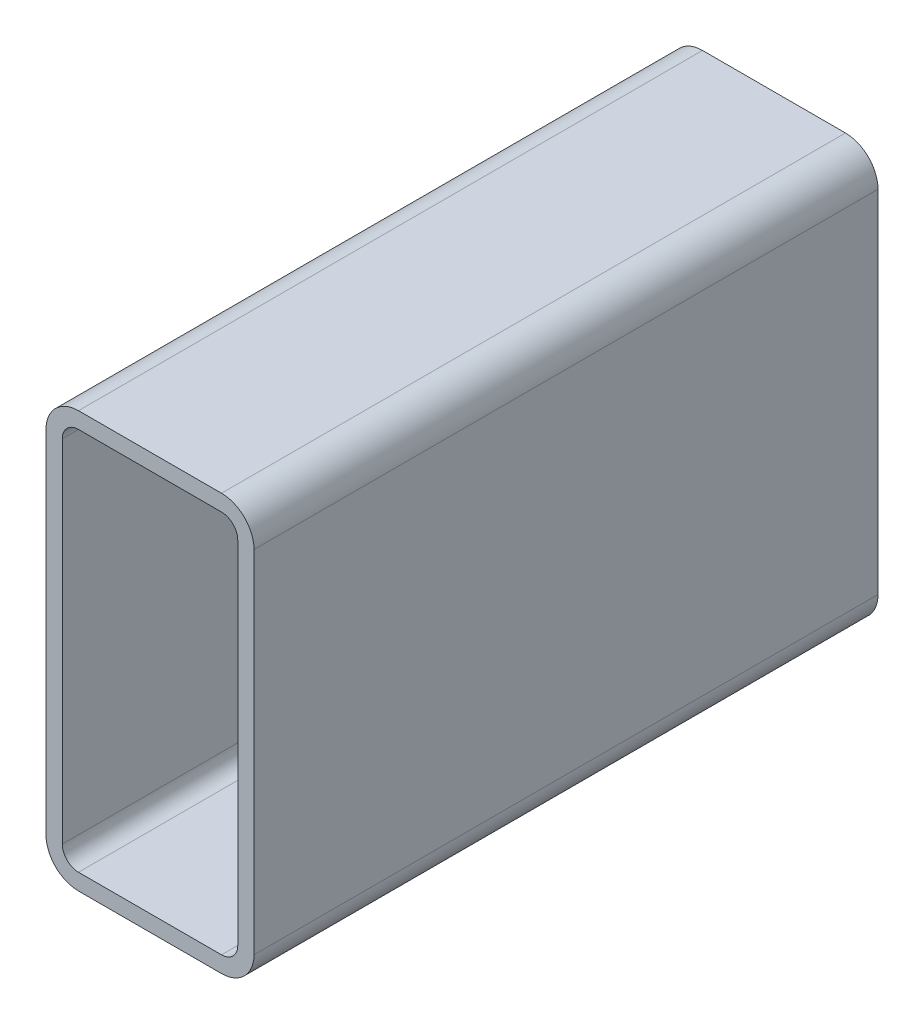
ISO-10303-21;
HEADER;
FILE_DESCRIPTION(('STEP AP214'),'2;1');
FILE_NAME('part.step','',(''),(''),'','','');
FILE_SCHEMA(('AUTOMOTIVE_DESIGN { 1 0 10303 214 1 1 1 1 }'));
ENDSEC;
DATA;
#1=APPLICATION_CONTEXT('core data for automotive mechanical design processes');
#2=APPLICATION_PROTOCOL_DEFINITION('international standard','automotive_design',2000,#1);
#3=PRODUCT_CONTEXT('',#1,'mechanical');
#4=PRODUCT('Part','Part','',(#3));
#5=PRODUCT_RELATED_PRODUCT_CATEGORY('part','',(#4));
#6=PRODUCT_DEFINITION_FORMATION('','',#4);
#7=PRODUCT_DEFINITION_CONTEXT('part definition',#1,'design');
#8=PRODUCT_DEFINITION('design','',#6,#7);
#9=PRODUCT_DEFINITION_SHAPE('','',#8);
#10=(LENGTH_UNIT() NAMED_UNIT(*) SI_UNIT(.MILLI.,.METRE.));
#11=(NAMED_UNIT(*) PLANE_ANGLE_UNIT() SI_UNIT($,.RADIAN.));
#12=(NAMED_UNIT(*) SI_UNIT($,.STERADIAN.) SOLID_ANGLE_UNIT());
#13=UNCERTAINTY_MEASURE_WITH_UNIT(LENGTH_MEASURE(1.E-05),#10,'distance_accuracy_value','');
#14=(GEOMETRIC_REPRESENTATION_CONTEXT(3) GLOBAL_UNCERTAINTY_ASSIGNED_CONTEXT((#13)) GLOBAL_UNIT_ASSIGNED_CONTEXT((#10,
#11,#12)) REPRESENTATION_CONTEXT('',''));
#15=CARTESIAN_POINT('',(0.,0.,0.));
#16=DIRECTION('',(0.,0.,1.));
#17=DIRECTION('',(1.,0.,0.));
#18=AXIS2_PLACEMENT_3D('',#15,#16,#17);
#19=CARTESIAN_POINT('',(17.5501778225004,189.291130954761,304.8));
#20=DIRECTION('',(0.,0.,1.));
#21=DIRECTION('',(1.,0.,0.));
#22=AXIS2_PLACEMENT_3D('',#19,#20,#21);
#23=PLANE('',#22);
#24=CARTESIAN_POINT('',(17.5501778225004,189.291130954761,304.8));
#25=DIRECTION('',(0.,0.,1.));
#26=DIRECTION('',(1.,0.,0.));
#27=AXIS2_PLACEMENT_3D('',#24,#25,#26);
#28=CIRCLE('',#27,15.875);
#29=CARTESIAN_POINT('',(17.5501778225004,205.166130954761,304.8));
#30=VERTEX_POINT('',#29);
#31=CARTESIAN_POINT('',(1.67517782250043,189.291130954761,304.8));
#32=VERTEX_POINT('',#31);
#33=EDGE_CURVE('E211',#30,#32,#28,.T.);
#34=ORIENTED_EDGE('',*,*,#33,.T.);
#35=DIRECTION('',(0.,-1.,0.));
#36=VECTOR('',#35,1.);
#37=CARTESIAN_POINT('',(1.67517782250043,17.8411309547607,304.8));
#38=LINE('',#37,#36);
#39=CARTESIAN_POINT('',(1.67517782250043,17.8411309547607,304.8));
#40=VERTEX_POINT('',#39);
#41=EDGE_CURVE('E214',#32,#40,#38,.T.);
#42=ORIENTED_EDGE('',*,*,#41,.T.);
#43=CARTESIAN_POINT('',(17.5501778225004,17.8411309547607,304.8));
#44=DIRECTION('',(0.,0.,1.));
#45=DIRECTION('',(1.,0.,0.));
#46=AXIS2_PLACEMENT_3D('',#43,#44,#45);
#47=CIRCLE('',#46,15.875);
#48=CARTESIAN_POINT('',(17.5501778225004,1.96613095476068,304.8));
#49=VERTEX_POINT('',#48);
#50=EDGE_CURVE('E217',#40,#49,#47,.T.);
#51=ORIENTED_EDGE('',*,*,#50,.T.);
#52=DIRECTION('',(1.,0.,0.));
#53=VECTOR('',#52,1.);
#54=CARTESIAN_POINT('',(87.4001778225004,1.96613095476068,304.8));
#55=LINE('',#54,#53);
#56=CARTESIAN_POINT('',(87.4001778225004,1.96613095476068,304.8));
#57=VERTEX_POINT('',#56);
#58=EDGE_CURVE('E219',#49,#57,#55,.T.);
#59=ORIENTED_EDGE('',*,*,#58,.T.);
#60=CARTESIAN_POINT('',(87.4001778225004,17.8411309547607,304.8));
#61=DIRECTION('',(0.,0.,1.));
#62=DIRECTION('',(1.,0.,0.));
#63=AXIS2_PLACEMENT_3D('',#60,#61,#62);
#64=CIRCLE('',#63,15.875);
#65=CARTESIAN_POINT('',(103.2751778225,17.8411309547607,304.8));
#66=VERTEX_POINT('',#65);
#67=EDGE_CURVE('E221',#57,#66,#64,.T.);
#68=ORIENTED_EDGE('',*,*,#67,.T.);
#69=DIRECTION('',(0.,1.,0.));
#70=VECTOR('',#69,1.);
#71=CARTESIAN_POINT('',(103.2751778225,189.291130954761,304.8));
#72=LINE('',#71,#70);
#73=CARTESIAN_POINT('',(103.2751778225,189.291130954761,304.8));
#74=VERTEX_POINT('',#73);
#75=EDGE_CURVE('E223',#66,#74,#72,.T.);
#76=ORIENTED_EDGE('',*,*,#75,.T.);
#77=CARTESIAN_POINT('',(87.4001778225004,189.291130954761,304.8));
#78=DIRECTION('',(0.,0.,1.));
#79=DIRECTION('',(1.,0.,0.));
#80=AXIS2_PLACEMENT_3D('',#77,#78,#79);
#81=CIRCLE('',#80,15.875);
#82=CARTESIAN_POINT('',(87.4001778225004,205.166130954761,304.8));
#83=VERTEX_POINT('',#82);
#84=EDGE_CURVE('E225',#74,#83,#81,.T.);
#85=ORIENTED_EDGE('',*,*,#84,.T.);
#86=DIRECTION('',(-1.,0.,0.));
#87=VECTOR('',#86,1.);
#88=CARTESIAN_POINT('',(17.5501778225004,205.166130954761,304.8));
#89=LINE('',#88,#87);
#90=EDGE_CURVE('E227',#83,#30,#89,.T.);
#91=ORIENTED_EDGE('',*,*,#90,.T.);
#92=EDGE_LOOP('',(#34,#42,#51,#59,#68,#76,#85,#91));
#93=FACE_BOUND('',#92,.T.);
#94=DIRECTION('',(0.,-1.,0.));
#95=VECTOR('',#94,1.);
#96=CARTESIAN_POINT('',(9.61267782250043,17.8411309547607,304.8));
#97=LINE('',#96,#95);
#98=CARTESIAN_POINT('',(9.61267782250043,189.291130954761,304.8));
#99=VERTEX_POINT('',#98);
#100=CARTESIAN_POINT('',(9.61267782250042,17.8411309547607,304.8));
#101=VERTEX_POINT('',#100);
#102=EDGE_CURVE('E154',#99,#101,#97,.T.);
#103=ORIENTED_EDGE('',*,*,#102,.F.);
#104=CARTESIAN_POINT('',(17.5501778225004,189.291130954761,304.8));
#105=DIRECTION('',(0.,0.,1.));
#106=DIRECTION('',(1.,0.,0.));
#107=AXIS2_PLACEMENT_3D('',#104,#105,#106);
#108=CIRCLE('',#107,7.9375);
#109=CARTESIAN_POINT('',(17.5501778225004,197.228630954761,304.8));
#110=VERTEX_POINT('',#109);
#111=EDGE_CURVE('E146',#110,#99,#108,.T.);
#112=ORIENTED_EDGE('',*,*,#111,.F.);
#113=DIRECTION('',(-1.,0.,0.));
#114=VECTOR('',#113,1.);
#115=CARTESIAN_POINT('',(17.5501778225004,197.228630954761,304.8));
#116=LINE('',#115,#114);
#117=CARTESIAN_POINT('',(87.4001778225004,197.228630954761,304.8));
#118=VERTEX_POINT('',#117);
#119=EDGE_CURVE('E179',#118,#110,#116,.T.);
#120=ORIENTED_EDGE('',*,*,#119,.F.);
#121=CARTESIAN_POINT('',(87.4001778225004,189.291130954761,304.8));
#122=DIRECTION('',(0.,0.,1.));
#123=DIRECTION('',(1.,0.,0.));
#124=AXIS2_PLACEMENT_3D('',#121,#122,#123);
#125=CIRCLE('',#124,7.93749999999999);
#126=CARTESIAN_POINT('',(95.3376778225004,189.291130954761,304.8));
#127=VERTEX_POINT('',#126);
#128=EDGE_CURVE('E177',#127,#118,#125,.T.);
#129=ORIENTED_EDGE('',*,*,#128,.F.);
#130=DIRECTION('',(0.,1.,0.));
#131=VECTOR('',#130,1.);
#132=CARTESIAN_POINT('',(95.3376778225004,189.291130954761,304.8));
#133=LINE('',#132,#131);
#134=CARTESIAN_POINT('',(95.3376778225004,17.8411309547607,304.8));
#135=VERTEX_POINT('',#134);
#136=EDGE_CURVE('E175',#135,#127,#133,.T.);
#137=ORIENTED_EDGE('',*,*,#136,.F.);
#138=CARTESIAN_POINT('',(87.4001778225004,17.8411309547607,304.8));
#139=DIRECTION('',(0.,0.,1.));
#140=DIRECTION('',(1.,0.,0.));
#141=AXIS2_PLACEMENT_3D('',#138,#139,#140);
#142=CIRCLE('',#141,7.9375);
#143=CARTESIAN_POINT('',(87.4001778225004,9.90363095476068,304.8));
#144=VERTEX_POINT('',#143);
#145=EDGE_CURVE('E173',#144,#135,#142,.T.);
#146=ORIENTED_EDGE('',*,*,#145,.F.);
#147=DIRECTION('',(1.,0.,0.));
#148=VECTOR('',#147,1.);
#149=CARTESIAN_POINT('',(87.4001778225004,9.90363095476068,304.8));
#150=LINE('',#149,#148);
#151=CARTESIAN_POINT('',(17.5501778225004,9.90363095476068,304.8));
#152=VERTEX_POINT('',#151);
#153=EDGE_CURVE('E169',#152,#144,#150,.T.);
#154=ORIENTED_EDGE('',*,*,#153,.F.);
#155=CARTESIAN_POINT('',(17.5501778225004,17.8411309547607,304.8));
#156=DIRECTION('',(0.,0.,1.));
#157=DIRECTION('',(1.,0.,0.));
#158=AXIS2_PLACEMENT_3D('',#155,#156,#157);
#159=CIRCLE('',#158,7.9375);
#160=EDGE_CURVE('E167',#101,#152,#159,.T.);
#161=ORIENTED_EDGE('',*,*,#160,.F.);
#162=EDGE_LOOP('',(#103,#112,#120,#129,#137,#146,#154,#161));
#163=FACE_BOUND('',#162,.T.);
#164=ADVANCED_FACE('F33',(#93,#163),#23,.T.);
#165=CARTESIAN_POINT('',(17.5501778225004,189.291130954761,0.));
#166=DIRECTION('',(0.,0.,1.));
#167=DIRECTION('',(1.,0.,0.));
#168=AXIS2_PLACEMENT_3D('',#165,#166,#167);
#169=PLANE('',#168);
#170=CARTESIAN_POINT('',(17.5501778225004,189.291130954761,0.));
#171=DIRECTION('',(0.,0.,1.));
#172=DIRECTION('',(1.,0.,0.));
#173=AXIS2_PLACEMENT_3D('',#170,#171,#172);
#174=CIRCLE('',#173,15.875);
#175=CARTESIAN_POINT('',(17.5501778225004,205.166130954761,0.));
#176=VERTEX_POINT('',#175);
#177=CARTESIAN_POINT('',(1.67517782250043,189.291130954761,0.));
#178=VERTEX_POINT('',#177);
#179=EDGE_CURVE('E162',#176,#178,#174,.T.);
#180=ORIENTED_EDGE('',*,*,#179,.F.);
#181=DIRECTION('',(-1.,0.,0.));
#182=VECTOR('',#181,1.);
#183=CARTESIAN_POINT('',(17.5501778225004,205.166130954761,0.));
#184=LINE('',#183,#182);
#185=CARTESIAN_POINT('',(87.4001778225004,205.166130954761,0.));
#186=VERTEX_POINT('',#185);
#187=EDGE_CURVE('E215',#186,#176,#184,.T.);
#188=ORIENTED_EDGE('',*,*,#187,.F.);
#189=CARTESIAN_POINT('',(87.4001778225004,189.291130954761,0.));
#190=DIRECTION('',(0.,0.,1.));
#191=DIRECTION('',(1.,0.,0.));
#192=AXIS2_PLACEMENT_3D('',#189,#190,#191);
#193=CIRCLE('',#192,15.875);
#194=CARTESIAN_POINT('',(103.2751778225,189.291130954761,0.));
#195=VERTEX_POINT('',#194);
#196=EDGE_CURVE('E242',#195,#186,#193,.T.);
#197=ORIENTED_EDGE('',*,*,#196,.F.);
#198=DIRECTION('',(0.,1.,0.));
#199=VECTOR('',#198,1.);
#200=CARTESIAN_POINT('',(103.2751778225,189.291130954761,0.));
#201=LINE('',#200,#199);
#202=CARTESIAN_POINT('',(103.2751778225,17.8411309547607,0.));
#203=VERTEX_POINT('',#202);
#204=EDGE_CURVE('E240',#203,#195,#201,.T.);
#205=ORIENTED_EDGE('',*,*,#204,.F.);
#206=CARTESIAN_POINT('',(87.4001778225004,17.8411309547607,0.));
#207=DIRECTION('',(0.,0.,1.));
#208=DIRECTION('',(1.,0.,0.));
#209=AXIS2_PLACEMENT_3D('',#206,#207,#208);
#210=CIRCLE('',#209,15.875);
#211=CARTESIAN_POINT('',(87.4001778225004,1.96613095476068,0.));
#212=VERTEX_POINT('',#211);
#213=EDGE_CURVE('E238',#212,#203,#210,.T.);
#214=ORIENTED_EDGE('',*,*,#213,.F.);
#215=DIRECTION('',(1.,0.,0.));
#216=VECTOR('',#215,1.);
#217=CARTESIAN_POINT('',(87.4001778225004,1.96613095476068,0.));
#218=LINE('',#217,#216);
#219=CARTESIAN_POINT('',(17.5501778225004,1.96613095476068,0.));
#220=VERTEX_POINT('',#219);
#221=EDGE_CURVE('E236',#220,#212,#218,.T.);
#222=ORIENTED_EDGE('',*,*,#221,.F.);
#223=CARTESIAN_POINT('',(17.5501778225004,17.8411309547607,0.));
#224=DIRECTION('',(0.,0.,1.));
#225=DIRECTION('',(1.,0.,0.));
#226=AXIS2_PLACEMENT_3D('',#223,#224,#225);
#227=CIRCLE('',#226,15.875);
#228=CARTESIAN_POINT('',(1.67517782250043,17.8411309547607,0.));
#229=VERTEX_POINT('',#228);
#230=EDGE_CURVE('E234',#229,#220,#227,.T.);
#231=ORIENTED_EDGE('',*,*,#230,.F.);
#232=DIRECTION('',(0.,-1.,0.));
#233=VECTOR('',#232,1.);
#234=CARTESIAN_POINT('',(1.67517782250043,17.8411309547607,0.));
#235=LINE('',#234,#233);
#236=EDGE_CURVE('E232',#178,#229,#235,.T.);
#237=ORIENTED_EDGE('',*,*,#236,.F.);
#238=EDGE_LOOP('',(#180,#188,#197,#205,#214,#222,#231,#237));
#239=FACE_BOUND('',#238,.T.);
#240=CARTESIAN_POINT('',(17.5501778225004,189.291130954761,0.));
#241=DIRECTION('',(0.,0.,1.));
#242=DIRECTION('',(1.,0.,0.));
#243=AXIS2_PLACEMENT_3D('',#240,#241,#242);
#244=CIRCLE('',#243,7.9375);
#245=CARTESIAN_POINT('',(17.5501778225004,197.228630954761,0.));
#246=VERTEX_POINT('',#245);
#247=CARTESIAN_POINT('',(9.61267782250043,189.291130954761,0.));
#248=VERTEX_POINT('',#247);
#249=EDGE_CURVE('E56',#246,#248,#244,.T.);
#250=ORIENTED_EDGE('',*,*,#249,.T.);
#251=DIRECTION('',(0.,-1.,0.));
#252=VECTOR('',#251,1.);
#253=CARTESIAN_POINT('',(9.61267782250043,17.8411309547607,0.));
#254=LINE('',#253,#252);
#255=CARTESIAN_POINT('',(9.61267782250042,17.8411309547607,0.));
#256=VERTEX_POINT('',#255);
#257=EDGE_CURVE('E161',#248,#256,#254,.T.);
#258=ORIENTED_EDGE('',*,*,#257,.T.);
#259=CARTESIAN_POINT('',(17.5501778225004,17.8411309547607,0.));
#260=DIRECTION('',(0.,0.,1.));
#261=DIRECTION('',(1.,0.,0.));
#262=AXIS2_PLACEMENT_3D('',#259,#260,#261);
#263=CIRCLE('',#262,7.9375);
#264=CARTESIAN_POINT('',(17.5501778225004,9.90363095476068,0.));
#265=VERTEX_POINT('',#264);
#266=EDGE_CURVE('E183',#256,#265,#263,.T.);
#267=ORIENTED_EDGE('',*,*,#266,.T.);
#268=DIRECTION('',(1.,0.,0.));
#269=VECTOR('',#268,1.);
#270=CARTESIAN_POINT('',(87.4001778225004,9.90363095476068,0.));
#271=LINE('',#270,#269);
#272=CARTESIAN_POINT('',(87.4001778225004,9.90363095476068,0.));
#273=VERTEX_POINT('',#272);
#274=EDGE_CURVE('E186',#265,#273,#271,.T.);
#275=ORIENTED_EDGE('',*,*,#274,.T.);
#276=CARTESIAN_POINT('',(87.4001778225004,17.8411309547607,0.));
#277=DIRECTION('',(0.,0.,1.));
#278=DIRECTION('',(1.,0.,0.));
#279=AXIS2_PLACEMENT_3D('',#276,#277,#278);
#280=CIRCLE('',#279,7.9375);
#281=CARTESIAN_POINT('',(95.3376778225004,17.8411309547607,0.));
#282=VERTEX_POINT('',#281);
#283=EDGE_CURVE('E189',#273,#282,#280,.T.);
#284=ORIENTED_EDGE('',*,*,#283,.T.);
#285=DIRECTION('',(0.,1.,0.));
#286=VECTOR('',#285,1.);
#287=CARTESIAN_POINT('',(95.3376778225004,189.291130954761,0.));
#288=LINE('',#287,#286);
#289=CARTESIAN_POINT('',(95.3376778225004,189.291130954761,0.));
#290=VERTEX_POINT('',#289);
#291=EDGE_CURVE('E192',#282,#290,#288,.T.);
#292=ORIENTED_EDGE('',*,*,#291,.T.);
#293=CARTESIAN_POINT('',(87.4001778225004,189.291130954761,0.));
#294=DIRECTION('',(0.,0.,1.));
#295=DIRECTION('',(1.,0.,0.));
#296=AXIS2_PLACEMENT_3D('',#293,#294,#295);
#297=CIRCLE('',#296,7.93749999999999);
#298=CARTESIAN_POINT('',(87.4001778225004,197.228630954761,0.));
#299=VERTEX_POINT('',#298);
#300=EDGE_CURVE('E195',#290,#299,#297,.T.);
#301=ORIENTED_EDGE('',*,*,#300,.T.);
#302=DIRECTION('',(-1.,0.,0.));
#303=VECTOR('',#302,1.);
#304=CARTESIAN_POINT('',(17.5501778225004,197.228630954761,0.));
#305=LINE('',#304,#303);
#306=EDGE_CURVE('E155',#299,#246,#305,.T.);
#307=ORIENTED_EDGE('',*,*,#306,.T.);
#308=EDGE_LOOP('',(#250,#258,#267,#275,#284,#292,#301,#307));
#309=FACE_BOUND('',#308,.T.);
#310=ADVANCED_FACE('F272',(#239,#309),#169,.F.);
#311=CARTESIAN_POINT('',(17.5501778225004,189.291130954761,304.8));
#312=DIRECTION('',(0.,0.,-1.));
#313=DIRECTION('',(-1.,0.,0.));
#314=AXIS2_PLACEMENT_3D('',#311,#312,#313);
#315=CYLINDRICAL_SURFACE('',#314,15.875);
#316=ORIENTED_EDGE('',*,*,#179,.T.);
#317=DIRECTION('',(0.,0.,-1.));
#318=VECTOR('',#317,1.);
#319=CARTESIAN_POINT('',(1.67517782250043,189.291130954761,304.8));
#320=LINE('',#319,#318);
#321=EDGE_CURVE('E11',#32,#178,#320,.T.);
#322=ORIENTED_EDGE('',*,*,#321,.F.);
#323=ORIENTED_EDGE('',*,*,#33,.F.);
#324=DIRECTION('',(0.,0.,-1.));
#325=VECTOR('',#324,1.);
#326=CARTESIAN_POINT('',(17.5501778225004,205.166130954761,304.8));
#327=LINE('',#326,#325);
#328=EDGE_CURVE('E229',#30,#176,#327,.T.);
#329=ORIENTED_EDGE('',*,*,#328,.T.);
#330=EDGE_LOOP('',(#316,#322,#323,#329));
#331=FACE_BOUND('',#330,.T.);
#332=ADVANCED_FACE('F35',(#331),#315,.T.);
#333=CARTESIAN_POINT('',(1.67517782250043,17.8411309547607,304.8));
#334=DIRECTION('',(1.,0.,0.));
#335=DIRECTION('',(0.,0.,-1.));
#336=AXIS2_PLACEMENT_3D('',#333,#334,#335);
#337=PLANE('',#336);
#338=ORIENTED_EDGE('',*,*,#236,.T.);
#339=DIRECTION('',(0.,0.,-1.));
#340=VECTOR('',#339,1.);
#341=CARTESIAN_POINT('',(1.67517782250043,17.8411309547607,304.8));
#342=LINE('',#341,#340);
#343=EDGE_CURVE('E41',#40,#229,#342,.T.);
#344=ORIENTED_EDGE('',*,*,#343,.F.);
#345=ORIENTED_EDGE('',*,*,#41,.F.);
#346=ORIENTED_EDGE('',*,*,#321,.T.);
#347=EDGE_LOOP('',(#338,#344,#345,#346));
#348=FACE_BOUND('',#347,.T.);
#349=ADVANCED_FACE('F289',(#348),#337,.F.);
#350=CARTESIAN_POINT('',(17.5501778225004,17.8411309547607,304.8));
#351=DIRECTION('',(0.,0.,-1.));
#352=DIRECTION('',(-1.,0.,0.));
#353=AXIS2_PLACEMENT_3D('',#350,#351,#352);
#354=CYLINDRICAL_SURFACE('',#353,15.875);
#355=ORIENTED_EDGE('',*,*,#230,.T.);
#356=DIRECTION('',(0.,0.,-1.));
#357=VECTOR('',#356,1.);
#358=CARTESIAN_POINT('',(17.5501778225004,1.96613095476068,304.8));
#359=LINE('',#358,#357);
#360=EDGE_CURVE('E259',#49,#220,#359,.T.);
#361=ORIENTED_EDGE('',*,*,#360,.F.);
#362=ORIENTED_EDGE('',*,*,#50,.F.);
#363=ORIENTED_EDGE('',*,*,#343,.T.);
#364=EDGE_LOOP('',(#355,#361,#362,#363));
#365=FACE_BOUND('',#364,.T.);
#366=ADVANCED_FACE('F266',(#365),#354,.T.);
#367=CARTESIAN_POINT('',(87.4001778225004,1.96613095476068,304.8));
#368=DIRECTION('',(0.,1.,0.));
#369=DIRECTION('',(0.,0.,1.));
#370=AXIS2_PLACEMENT_3D('',#367,#368,#369);
#371=PLANE('',#370);
#372=ORIENTED_EDGE('',*,*,#221,.T.);
#373=DIRECTION('',(0.,0.,-1.));
#374=VECTOR('',#373,1.);
#375=CARTESIAN_POINT('',(87.4001778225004,1.96613095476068,304.8));
#376=LINE('',#375,#374);
#377=EDGE_CURVE('E256',#57,#212,#376,.T.);
#378=ORIENTED_EDGE('',*,*,#377,.F.);
#379=ORIENTED_EDGE('',*,*,#58,.F.);
#380=ORIENTED_EDGE('',*,*,#360,.T.);
#381=EDGE_LOOP('',(#372,#378,#379,#380));
#382=FACE_BOUND('',#381,.T.);
#383=ADVANCED_FACE('F278',(#382),#371,.F.);
#384=CARTESIAN_POINT('',(87.4001778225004,17.8411309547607,304.8));
#385=DIRECTION('',(0.,0.,-1.));
#386=DIRECTION('',(-1.,0.,0.));
#387=AXIS2_PLACEMENT_3D('',#384,#385,#386);
#388=CYLINDRICAL_SURFACE('',#387,15.875);
#389=ORIENTED_EDGE('',*,*,#213,.T.);
#390=DIRECTION('',(0.,0.,-1.));
#391=VECTOR('',#390,1.);
#392=CARTESIAN_POINT('',(103.2751778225,17.8411309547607,304.8));
#393=LINE('',#392,#391);
#394=EDGE_CURVE('E253',#66,#203,#393,.T.);
#395=ORIENTED_EDGE('',*,*,#394,.F.);
#396=ORIENTED_EDGE('',*,*,#67,.F.);
#397=ORIENTED_EDGE('',*,*,#377,.T.);
#398=EDGE_LOOP('',(#389,#395,#396,#397));
#399=FACE_BOUND('',#398,.T.);
#400=ADVANCED_FACE('F282',(#399),#388,.T.);
#401=CARTESIAN_POINT('',(103.2751778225,189.291130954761,304.8));
#402=DIRECTION('',(-1.,0.,0.));
#403=DIRECTION('',(0.,0.,1.));
#404=AXIS2_PLACEMENT_3D('',#401,#402,#403);
#405=PLANE('',#404);
#406=ORIENTED_EDGE('',*,*,#204,.T.);
#407=DIRECTION('',(0.,0.,-1.));
#408=VECTOR('',#407,1.);
#409=CARTESIAN_POINT('',(103.2751778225,189.291130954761,304.8));
#410=LINE('',#409,#408);
#411=EDGE_CURVE('E250',#74,#195,#410,.T.);
#412=ORIENTED_EDGE('',*,*,#411,.F.);
#413=ORIENTED_EDGE('',*,*,#75,.F.);
#414=ORIENTED_EDGE('',*,*,#394,.T.);
#415=EDGE_LOOP('',(#406,#412,#413,#414));
#416=FACE_BOUND('',#415,.T.);
#417=ADVANCED_FACE('F302',(#416),#405,.F.);
#418=CARTESIAN_POINT('',(87.4001778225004,189.291130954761,304.8));
#419=DIRECTION('',(0.,0.,-1.));
#420=DIRECTION('',(-1.,0.,0.));
#421=AXIS2_PLACEMENT_3D('',#418,#419,#420);
#422=CYLINDRICAL_SURFACE('',#421,15.875);
#423=ORIENTED_EDGE('',*,*,#196,.T.);
#424=DIRECTION('',(0.,0.,-1.));
#425=VECTOR('',#424,1.);
#426=CARTESIAN_POINT('',(87.4001778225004,205.166130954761,304.8));
#427=LINE('',#426,#425);
#428=EDGE_CURVE('E247',#83,#186,#427,.T.);
#429=ORIENTED_EDGE('',*,*,#428,.F.);
#430=ORIENTED_EDGE('',*,*,#84,.F.);
#431=ORIENTED_EDGE('',*,*,#411,.T.);
#432=EDGE_LOOP('',(#423,#429,#430,#431));
#433=FACE_BOUND('',#432,.T.);
#434=ADVANCED_FACE('F300',(#433),#422,.T.);
#435=CARTESIAN_POINT('',(17.5501778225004,205.166130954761,304.8));
#436=DIRECTION('',(0.,-1.,0.));
#437=DIRECTION('',(0.,0.,-1.));
#438=AXIS2_PLACEMENT_3D('',#435,#436,#437);
#439=PLANE('',#438);
#440=ORIENTED_EDGE('',*,*,#187,.T.);
#441=ORIENTED_EDGE('',*,*,#328,.F.);
#442=ORIENTED_EDGE('',*,*,#90,.F.);
#443=ORIENTED_EDGE('',*,*,#428,.T.);
#444=EDGE_LOOP('',(#440,#441,#442,#443));
#445=FACE_BOUND('',#444,.T.);
#446=ADVANCED_FACE('F295',(#445),#439,.F.);
#447=CARTESIAN_POINT('',(17.5501778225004,189.291130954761,304.8));
#448=DIRECTION('',(0.,0.,-1.));
#449=DIRECTION('',(-1.,0.,0.));
#450=AXIS2_PLACEMENT_3D('',#447,#448,#449);
#451=CYLINDRICAL_SURFACE('',#450,7.9375);
#452=ORIENTED_EDGE('',*,*,#249,.F.);
#453=DIRECTION('',(0.,0.,-1.));
#454=VECTOR('',#453,1.);
#455=CARTESIAN_POINT('',(17.5501778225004,197.228630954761,304.8));
#456=LINE('',#455,#454);
#457=EDGE_CURVE('E150',#110,#246,#456,.T.);
#458=ORIENTED_EDGE('',*,*,#457,.F.);
#459=ORIENTED_EDGE('',*,*,#111,.T.);
#460=DIRECTION('',(0.,0.,-1.));
#461=VECTOR('',#460,1.);
#462=CARTESIAN_POINT('',(9.61267782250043,189.291130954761,304.8));
#463=LINE('',#462,#461);
#464=EDGE_CURVE('E149',#99,#248,#463,.T.);
#465=ORIENTED_EDGE('',*,*,#464,.T.);
#466=EDGE_LOOP('',(#452,#458,#459,#465));
#467=FACE_BOUND('',#466,.T.);
#468=ADVANCED_FACE('F148',(#467),#451,.F.);
#469=CARTESIAN_POINT('',(9.61267782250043,17.8411309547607,304.8));
#470=DIRECTION('',(1.,0.,0.));
#471=DIRECTION('',(0.,0.,-1.));
#472=AXIS2_PLACEMENT_3D('',#469,#470,#471);
#473=PLANE('',#472);
#474=ORIENTED_EDGE('',*,*,#257,.F.);
#475=ORIENTED_EDGE('',*,*,#464,.F.);
#476=ORIENTED_EDGE('',*,*,#102,.T.);
#477=DIRECTION('',(0.,0.,-1.));
#478=VECTOR('',#477,1.);
#479=CARTESIAN_POINT('',(9.61267782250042,17.8411309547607,304.8));
#480=LINE('',#479,#478);
#481=EDGE_CURVE('E163',#101,#256,#480,.T.);
#482=ORIENTED_EDGE('',*,*,#481,.T.);
#483=EDGE_LOOP('',(#474,#475,#476,#482));
#484=FACE_BOUND('',#483,.T.);
#485=ADVANCED_FACE('F158',(#484),#473,.T.);
#486=CARTESIAN_POINT('',(17.5501778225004,17.8411309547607,304.8));
#487=DIRECTION('',(0.,0.,-1.));
#488=DIRECTION('',(-1.,0.,0.));
#489=AXIS2_PLACEMENT_3D('',#486,#487,#488);
#490=CYLINDRICAL_SURFACE('',#489,7.9375);
#491=ORIENTED_EDGE('',*,*,#266,.F.);
#492=ORIENTED_EDGE('',*,*,#481,.F.);
#493=ORIENTED_EDGE('',*,*,#160,.T.);
#494=DIRECTION('',(0.,0.,-1.));
#495=VECTOR('',#494,1.);
#496=CARTESIAN_POINT('',(17.5501778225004,9.90363095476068,304.8));
#497=LINE('',#496,#495);
#498=EDGE_CURVE('E208',#152,#265,#497,.T.);
#499=ORIENTED_EDGE('',*,*,#498,.T.);
#500=EDGE_LOOP('',(#491,#492,#493,#499));
#501=FACE_BOUND('',#500,.T.);
#502=ADVANCED_FACE('F327',(#501),#490,.F.);
#503=CARTESIAN_POINT('',(87.4001778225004,9.90363095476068,304.8));
#504=DIRECTION('',(0.,1.,0.));
#505=DIRECTION('',(0.,0.,1.));
#506=AXIS2_PLACEMENT_3D('',#503,#504,#505);
#507=PLANE('',#506);
#508=ORIENTED_EDGE('',*,*,#274,.F.);
#509=ORIENTED_EDGE('',*,*,#498,.F.);
#510=ORIENTED_EDGE('',*,*,#153,.T.);
#511=DIRECTION('',(0.,0.,-1.));
#512=VECTOR('',#511,1.);
#513=CARTESIAN_POINT('',(87.4001778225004,9.90363095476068,304.8));
#514=LINE('',#513,#512);
#515=EDGE_CURVE('E206',#144,#273,#514,.T.);
#516=ORIENTED_EDGE('',*,*,#515,.T.);
#517=EDGE_LOOP('',(#508,#509,#510,#516));
#518=FACE_BOUND('',#517,.T.);
#519=ADVANCED_FACE('F331',(#518),#507,.T.);
#520=CARTESIAN_POINT('',(87.4001778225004,17.8411309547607,304.8));
#521=DIRECTION('',(0.,0.,-1.));
#522=DIRECTION('',(-1.,0.,0.));
#523=AXIS2_PLACEMENT_3D('',#520,#521,#522);
#524=CYLINDRICAL_SURFACE('',#523,7.9375);
#525=ORIENTED_EDGE('',*,*,#283,.F.);
#526=ORIENTED_EDGE('',*,*,#515,.F.);
#527=ORIENTED_EDGE('',*,*,#145,.T.);
#528=DIRECTION('',(0.,0.,-1.));
#529=VECTOR('',#528,1.);
#530=CARTESIAN_POINT('',(95.3376778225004,17.8411309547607,304.8));
#531=LINE('',#530,#529);
#532=EDGE_CURVE('E204',#135,#282,#531,.T.);
#533=ORIENTED_EDGE('',*,*,#532,.T.);
#534=EDGE_LOOP('',(#525,#526,#527,#533));
#535=FACE_BOUND('',#534,.T.);
#536=ADVANCED_FACE('F337',(#535),#524,.F.);
#537=CARTESIAN_POINT('',(95.3376778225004,189.291130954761,304.8));
#538=DIRECTION('',(-1.,0.,0.));
#539=DIRECTION('',(0.,0.,1.));
#540=AXIS2_PLACEMENT_3D('',#537,#538,#539);
#541=PLANE('',#540);
#542=ORIENTED_EDGE('',*,*,#291,.F.);
#543=ORIENTED_EDGE('',*,*,#532,.F.);
#544=ORIENTED_EDGE('',*,*,#136,.T.);
#545=DIRECTION('',(0.,0.,-1.));
#546=VECTOR('',#545,1.);
#547=CARTESIAN_POINT('',(95.3376778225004,189.291130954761,304.8));
#548=LINE('',#547,#546);
#549=EDGE_CURVE('E202',#127,#290,#548,.T.);
#550=ORIENTED_EDGE('',*,*,#549,.T.);
#551=EDGE_LOOP('',(#542,#543,#544,#550));
#552=FACE_BOUND('',#551,.T.);
#553=ADVANCED_FACE('F341',(#552),#541,.T.);
#554=CARTESIAN_POINT('',(87.4001778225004,189.291130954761,304.8));
#555=DIRECTION('',(0.,0.,-1.));
#556=DIRECTION('',(-1.,0.,0.));
#557=AXIS2_PLACEMENT_3D('',#554,#555,#556);
#558=CYLINDRICAL_SURFACE('',#557,7.93749999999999);
#559=ORIENTED_EDGE('',*,*,#300,.F.);
#560=ORIENTED_EDGE('',*,*,#549,.F.);
#561=ORIENTED_EDGE('',*,*,#128,.T.);
#562=DIRECTION('',(0.,0.,-1.));
#563=VECTOR('',#562,1.);
#564=CARTESIAN_POINT('',(87.4001778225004,197.228630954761,304.8));
#565=LINE('',#564,#563);
#566=EDGE_CURVE('E48',#118,#299,#565,.T.);
#567=ORIENTED_EDGE('',*,*,#566,.T.);
#568=EDGE_LOOP('',(#559,#560,#561,#567));
#569=FACE_BOUND('',#568,.T.);
#570=ADVANCED_FACE('F345',(#569),#558,.F.);
#571=CARTESIAN_POINT('',(17.5501778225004,197.228630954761,304.8));
#572=DIRECTION('',(0.,-1.,0.));
#573=DIRECTION('',(0.,0.,-1.));
#574=AXIS2_PLACEMENT_3D('',#571,#572,#573);
#575=PLANE('',#574);
#576=ORIENTED_EDGE('',*,*,#306,.F.);
#577=ORIENTED_EDGE('',*,*,#566,.F.);
#578=ORIENTED_EDGE('',*,*,#119,.T.);
#579=ORIENTED_EDGE('',*,*,#457,.T.);
#580=EDGE_LOOP('',(#576,#577,#578,#579));
#581=FACE_BOUND('',#580,.T.);
#582=ADVANCED_FACE('F349',(#581),#575,.T.);
#583=CLOSED_SHELL('',(#164,#310,#332,#349,#366,#383,#400,#417,#434,#446,#468,#485,#502,#519,
#536,#553,#570,#582));
#584=MANIFOLD_SOLID_BREP('B2',#583);
#585=ADVANCED_BREP_SHAPE_REPRESENTATION('',(#18,#584),#14);
#586=SHAPE_DEFINITION_REPRESENTATION(#9,#585);
ENDSEC;
END-ISO-10303-21;
